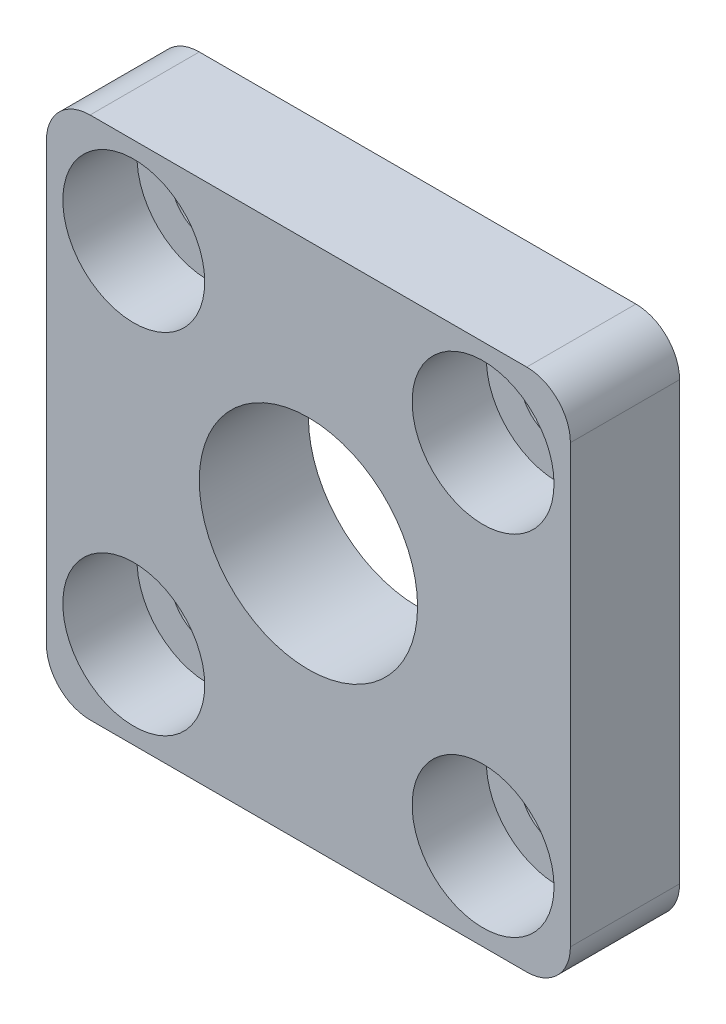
ISO-10303-21;
HEADER;
FILE_DESCRIPTION(('STEP AP214'),'2;1');
FILE_NAME('part.step','',(''),(''),'','','');
FILE_SCHEMA(('AUTOMOTIVE_DESIGN { 1 0 10303 214 1 1 1 1 }'));
ENDSEC;
DATA;
#1=APPLICATION_CONTEXT('core data for automotive mechanical design processes');
#2=APPLICATION_PROTOCOL_DEFINITION('international standard','automotive_design',2000,#1);
#3=PRODUCT_CONTEXT('',#1,'mechanical');
#4=PRODUCT('Part','Part','',(#3));
#5=PRODUCT_RELATED_PRODUCT_CATEGORY('part','',(#4));
#6=PRODUCT_DEFINITION_FORMATION('','',#4);
#7=PRODUCT_DEFINITION_CONTEXT('part definition',#1,'design');
#8=PRODUCT_DEFINITION('design','',#6,#7);
#9=PRODUCT_DEFINITION_SHAPE('','',#8);
#10=(LENGTH_UNIT() NAMED_UNIT(*) SI_UNIT(.MILLI.,.METRE.));
#11=(NAMED_UNIT(*) PLANE_ANGLE_UNIT() SI_UNIT($,.RADIAN.));
#12=(NAMED_UNIT(*) SI_UNIT($,.STERADIAN.) SOLID_ANGLE_UNIT());
#13=UNCERTAINTY_MEASURE_WITH_UNIT(LENGTH_MEASURE(1.E-05),#10,'distance_accuracy_value','');
#14=(GEOMETRIC_REPRESENTATION_CONTEXT(3) GLOBAL_UNCERTAINTY_ASSIGNED_CONTEXT((#13)) GLOBAL_UNIT_ASSIGNED_CONTEXT((#10,
#11,#12)) REPRESENTATION_CONTEXT('',''));
#15=CARTESIAN_POINT('',(0.,0.,0.));
#16=DIRECTION('',(0.,0.,1.));
#17=DIRECTION('',(1.,0.,0.));
#18=AXIS2_PLACEMENT_3D('',#15,#16,#17);
#19=CARTESIAN_POINT('',(0.,0.,5.));
#20=DIRECTION('',(0.,0.,-1.));
#21=DIRECTION('',(-1.,0.,0.));
#22=AXIS2_PLACEMENT_3D('',#19,#20,#21);
#23=PLANE('',#22);
#24=CARTESIAN_POINT('',(-8.,8.,5.));
#25=DIRECTION('',(0.,0.,1.));
#26=DIRECTION('',(1.,0.,0.));
#27=AXIS2_PLACEMENT_3D('',#24,#25,#26);
#28=CIRCLE('',#27,3.25);
#29=CARTESIAN_POINT('',(-4.75,8.,5.));
#30=VERTEX_POINT('',#29);
#31=EDGE_CURVE('E267',#30,#30,#28,.T.);
#32=ORIENTED_EDGE('',*,*,#31,.F.);
#33=EDGE_LOOP('',(#32));
#34=FACE_BOUND('',#33,.T.);
#35=CARTESIAN_POINT('',(8.,8.,5.));
#36=DIRECTION('',(0.,0.,1.));
#37=DIRECTION('',(1.,0.,0.));
#38=AXIS2_PLACEMENT_3D('',#35,#36,#37);
#39=CIRCLE('',#38,3.25);
#40=CARTESIAN_POINT('',(11.25,8.,5.));
#41=VERTEX_POINT('',#40);
#42=EDGE_CURVE('E251',#41,#41,#39,.T.);
#43=ORIENTED_EDGE('',*,*,#42,.F.);
#44=EDGE_LOOP('',(#43));
#45=FACE_BOUND('',#44,.T.);
#46=CARTESIAN_POINT('',(8.,-8.,5.));
#47=DIRECTION('',(0.,0.,1.));
#48=DIRECTION('',(1.,0.,0.));
#49=AXIS2_PLACEMENT_3D('',#46,#47,#48);
#50=CIRCLE('',#49,3.25);
#51=CARTESIAN_POINT('',(11.25,-8.,5.));
#52=VERTEX_POINT('',#51);
#53=EDGE_CURVE('E235',#52,#52,#50,.T.);
#54=ORIENTED_EDGE('',*,*,#53,.F.);
#55=EDGE_LOOP('',(#54));
#56=FACE_BOUND('',#55,.T.);
#57=CARTESIAN_POINT('',(-8.,-8.,5.));
#58=DIRECTION('',(0.,0.,1.));
#59=DIRECTION('',(1.,0.,0.));
#60=AXIS2_PLACEMENT_3D('',#57,#58,#59);
#61=CIRCLE('',#60,3.25);
#62=CARTESIAN_POINT('',(-4.75,-8.,5.));
#63=VERTEX_POINT('',#62);
#64=EDGE_CURVE('E219',#63,#63,#61,.T.);
#65=ORIENTED_EDGE('',*,*,#64,.F.);
#66=EDGE_LOOP('',(#65));
#67=FACE_BOUND('',#66,.T.);
#68=DIRECTION('',(0.,-1.,0.));
#69=VECTOR('',#68,1.);
#70=CARTESIAN_POINT('',(-12.,-12.,5.));
#71=LINE('',#70,#69);
#72=CARTESIAN_POINT('',(-12.,10.,5.));
#73=VERTEX_POINT('',#72);
#74=CARTESIAN_POINT('',(-12.,-10.,5.));
#75=VERTEX_POINT('',#74);
#76=EDGE_CURVE('E194',#73,#75,#71,.T.);
#77=ORIENTED_EDGE('',*,*,#76,.T.);
#78=CARTESIAN_POINT('',(-10.,-10.,5.));
#79=DIRECTION('',(0.,0.,-1.));
#80=DIRECTION('',(-1.,0.,0.));
#81=AXIS2_PLACEMENT_3D('',#78,#79,#80);
#82=CIRCLE('',#81,2.);
#83=CARTESIAN_POINT('',(-10.,-12.,5.));
#84=VERTEX_POINT('',#83);
#85=EDGE_CURVE('E168',#75,#84,#82,.F.);
#86=ORIENTED_EDGE('',*,*,#85,.T.);
#87=DIRECTION('',(1.,0.,0.));
#88=VECTOR('',#87,1.);
#89=CARTESIAN_POINT('',(-12.,-12.,5.));
#90=LINE('',#89,#88);
#91=CARTESIAN_POINT('',(10.,-12.,5.));
#92=VERTEX_POINT('',#91);
#93=EDGE_CURVE('E125',#84,#92,#90,.T.);
#94=ORIENTED_EDGE('',*,*,#93,.T.);
#95=CARTESIAN_POINT('',(10.,-10.,5.));
#96=DIRECTION('',(0.,0.,-1.));
#97=DIRECTION('',(-1.,0.,0.));
#98=AXIS2_PLACEMENT_3D('',#95,#96,#97);
#99=CIRCLE('',#98,2.);
#100=CARTESIAN_POINT('',(12.,-10.,5.));
#101=VERTEX_POINT('',#100);
#102=EDGE_CURVE('E165',#92,#101,#99,.F.);
#103=ORIENTED_EDGE('',*,*,#102,.T.);
#104=DIRECTION('',(0.,1.,0.));
#105=VECTOR('',#104,1.);
#106=CARTESIAN_POINT('',(12.,-12.,5.));
#107=LINE('',#106,#105);
#108=CARTESIAN_POINT('',(12.,10.,5.));
#109=VERTEX_POINT('',#108);
#110=EDGE_CURVE('E134',#101,#109,#107,.T.);
#111=ORIENTED_EDGE('',*,*,#110,.T.);
#112=CARTESIAN_POINT('',(10.,10.,5.));
#113=DIRECTION('',(0.,0.,-1.));
#114=DIRECTION('',(-1.,0.,0.));
#115=AXIS2_PLACEMENT_3D('',#112,#113,#114);
#116=CIRCLE('',#115,2.);
#117=CARTESIAN_POINT('',(10.,12.,5.));
#118=VERTEX_POINT('',#117);
#119=EDGE_CURVE('E59',#109,#118,#116,.F.);
#120=ORIENTED_EDGE('',*,*,#119,.T.);
#121=DIRECTION('',(-1.,0.,0.));
#122=VECTOR('',#121,1.);
#123=CARTESIAN_POINT('',(-12.,12.,5.));
#124=LINE('',#123,#122);
#125=CARTESIAN_POINT('',(-10.,12.,5.));
#126=VERTEX_POINT('',#125);
#127=EDGE_CURVE('E140',#118,#126,#124,.T.);
#128=ORIENTED_EDGE('',*,*,#127,.T.);
#129=CARTESIAN_POINT('',(-10.,10.,5.));
#130=DIRECTION('',(0.,0.,-1.));
#131=DIRECTION('',(-1.,0.,0.));
#132=AXIS2_PLACEMENT_3D('',#129,#130,#131);
#133=CIRCLE('',#132,2.);
#134=EDGE_CURVE('E162',#126,#73,#133,.F.);
#135=ORIENTED_EDGE('',*,*,#134,.T.);
#136=EDGE_LOOP('',(#77,#86,#94,#103,#111,#120,#128,#135));
#137=FACE_BOUND('',#136,.T.);
#138=CARTESIAN_POINT('',(0.,0.,5.));
#139=DIRECTION('',(0.,0.,1.));
#140=DIRECTION('',(1.,0.,0.));
#141=AXIS2_PLACEMENT_3D('',#138,#139,#140);
#142=CIRCLE('',#141,5.);
#143=CARTESIAN_POINT('',(5.,0.,5.));
#144=VERTEX_POINT('',#143);
#145=EDGE_CURVE('E189',#144,#144,#142,.T.);
#146=ORIENTED_EDGE('',*,*,#145,.F.);
#147=EDGE_LOOP('',(#146));
#148=FACE_BOUND('',#147,.T.);
#149=ADVANCED_FACE('F38',(#34,#45,#56,#67,#137,#148),#23,.F.);
#150=CARTESIAN_POINT('',(0.,0.,0.));
#151=DIRECTION('',(0.,0.,-1.));
#152=DIRECTION('',(-1.,0.,0.));
#153=AXIS2_PLACEMENT_3D('',#150,#151,#152);
#154=PLANE('',#153);
#155=CARTESIAN_POINT('',(-8.,8.,0.));
#156=DIRECTION('',(0.,0.,1.));
#157=DIRECTION('',(1.,0.,0.));
#158=AXIS2_PLACEMENT_3D('',#155,#156,#157);
#159=CIRCLE('',#158,1.7);
#160=CARTESIAN_POINT('',(-6.3,8.,0.));
#161=VERTEX_POINT('',#160);
#162=EDGE_CURVE('E255',#161,#161,#159,.T.);
#163=ORIENTED_EDGE('',*,*,#162,.T.);
#164=EDGE_LOOP('',(#163));
#165=FACE_BOUND('',#164,.T.);
#166=CARTESIAN_POINT('',(8.,8.,0.));
#167=DIRECTION('',(0.,0.,1.));
#168=DIRECTION('',(1.,0.,0.));
#169=AXIS2_PLACEMENT_3D('',#166,#167,#168);
#170=CIRCLE('',#169,1.7);
#171=CARTESIAN_POINT('',(9.7,8.,0.));
#172=VERTEX_POINT('',#171);
#173=EDGE_CURVE('E239',#172,#172,#170,.T.);
#174=ORIENTED_EDGE('',*,*,#173,.T.);
#175=EDGE_LOOP('',(#174));
#176=FACE_BOUND('',#175,.T.);
#177=CARTESIAN_POINT('',(8.,-8.,0.));
#178=DIRECTION('',(0.,0.,1.));
#179=DIRECTION('',(1.,0.,0.));
#180=AXIS2_PLACEMENT_3D('',#177,#178,#179);
#181=CIRCLE('',#180,1.7);
#182=CARTESIAN_POINT('',(9.7,-8.,0.));
#183=VERTEX_POINT('',#182);
#184=EDGE_CURVE('E223',#183,#183,#181,.T.);
#185=ORIENTED_EDGE('',*,*,#184,.T.);
#186=EDGE_LOOP('',(#185));
#187=FACE_BOUND('',#186,.T.);
#188=CARTESIAN_POINT('',(-8.,-8.,0.));
#189=DIRECTION('',(0.,0.,1.));
#190=DIRECTION('',(1.,0.,0.));
#191=AXIS2_PLACEMENT_3D('',#188,#189,#190);
#192=CIRCLE('',#191,1.7);
#193=CARTESIAN_POINT('',(-6.3,-8.,0.));
#194=VERTEX_POINT('',#193);
#195=EDGE_CURVE('E204',#194,#194,#192,.T.);
#196=ORIENTED_EDGE('',*,*,#195,.T.);
#197=EDGE_LOOP('',(#196));
#198=FACE_BOUND('',#197,.T.);
#199=DIRECTION('',(1.,0.,0.));
#200=VECTOR('',#199,1.);
#201=CARTESIAN_POINT('',(-12.,-12.,0.));
#202=LINE('',#201,#200);
#203=CARTESIAN_POINT('',(-10.,-12.,0.));
#204=VERTEX_POINT('',#203);
#205=CARTESIAN_POINT('',(10.,-12.,0.));
#206=VERTEX_POINT('',#205);
#207=EDGE_CURVE('E122',#204,#206,#202,.T.);
#208=ORIENTED_EDGE('',*,*,#207,.F.);
#209=CARTESIAN_POINT('',(-10.,-10.,0.));
#210=DIRECTION('',(0.,0.,-1.));
#211=DIRECTION('',(-1.,0.,0.));
#212=AXIS2_PLACEMENT_3D('',#209,#210,#211);
#213=CIRCLE('',#212,2.);
#214=CARTESIAN_POINT('',(-12.,-10.,0.));
#215=VERTEX_POINT('',#214);
#216=EDGE_CURVE('E104',#204,#215,#213,.T.);
#217=ORIENTED_EDGE('',*,*,#216,.T.);
#218=DIRECTION('',(0.,-1.,0.));
#219=VECTOR('',#218,1.);
#220=CARTESIAN_POINT('',(-12.,-12.,0.));
#221=LINE('',#220,#219);
#222=CARTESIAN_POINT('',(-12.,10.,0.));
#223=VERTEX_POINT('',#222);
#224=EDGE_CURVE('E135',#223,#215,#221,.T.);
#225=ORIENTED_EDGE('',*,*,#224,.F.);
#226=CARTESIAN_POINT('',(-10.,10.,0.));
#227=DIRECTION('',(0.,0.,-1.));
#228=DIRECTION('',(-1.,0.,0.));
#229=AXIS2_PLACEMENT_3D('',#226,#227,#228);
#230=CIRCLE('',#229,2.);
#231=CARTESIAN_POINT('',(-10.,12.,0.));
#232=VERTEX_POINT('',#231);
#233=EDGE_CURVE('E150',#223,#232,#230,.T.);
#234=ORIENTED_EDGE('',*,*,#233,.T.);
#235=DIRECTION('',(-1.,0.,0.));
#236=VECTOR('',#235,1.);
#237=CARTESIAN_POINT('',(-12.,12.,0.));
#238=LINE('',#237,#236);
#239=CARTESIAN_POINT('',(10.,12.,0.));
#240=VERTEX_POINT('',#239);
#241=EDGE_CURVE('E142',#240,#232,#238,.T.);
#242=ORIENTED_EDGE('',*,*,#241,.F.);
#243=CARTESIAN_POINT('',(10.,10.,0.));
#244=DIRECTION('',(0.,0.,-1.));
#245=DIRECTION('',(-1.,0.,0.));
#246=AXIS2_PLACEMENT_3D('',#243,#244,#245);
#247=CIRCLE('',#246,2.);
#248=CARTESIAN_POINT('',(12.,10.,0.));
#249=VERTEX_POINT('',#248);
#250=EDGE_CURVE('E127',#240,#249,#247,.T.);
#251=ORIENTED_EDGE('',*,*,#250,.T.);
#252=DIRECTION('',(0.,1.,0.));
#253=VECTOR('',#252,1.);
#254=CARTESIAN_POINT('',(12.,-12.,0.));
#255=LINE('',#254,#253);
#256=CARTESIAN_POINT('',(12.,-10.,0.));
#257=VERTEX_POINT('',#256);
#258=EDGE_CURVE('E186',#257,#249,#255,.T.);
#259=ORIENTED_EDGE('',*,*,#258,.F.);
#260=CARTESIAN_POINT('',(10.,-10.,0.));
#261=DIRECTION('',(0.,0.,-1.));
#262=DIRECTION('',(-1.,0.,0.));
#263=AXIS2_PLACEMENT_3D('',#260,#261,#262);
#264=CIRCLE('',#263,2.);
#265=EDGE_CURVE('E116',#257,#206,#264,.T.);
#266=ORIENTED_EDGE('',*,*,#265,.T.);
#267=EDGE_LOOP('',(#208,#217,#225,#234,#242,#251,#259,#266));
#268=FACE_BOUND('',#267,.T.);
#269=CARTESIAN_POINT('',(0.,0.,0.));
#270=DIRECTION('',(0.,0.,1.));
#271=DIRECTION('',(1.,0.,0.));
#272=AXIS2_PLACEMENT_3D('',#269,#270,#271);
#273=CIRCLE('',#272,5.);
#274=CARTESIAN_POINT('',(5.,0.,0.));
#275=VERTEX_POINT('',#274);
#276=EDGE_CURVE('E200',#275,#275,#273,.T.);
#277=ORIENTED_EDGE('',*,*,#276,.T.);
#278=EDGE_LOOP('',(#277));
#279=FACE_BOUND('',#278,.T.);
#280=ADVANCED_FACE('F130',(#165,#176,#187,#198,#268,#279),#154,.T.);
#281=CARTESIAN_POINT('',(12.,-12.,5.));
#282=DIRECTION('',(-1.,0.,0.));
#283=DIRECTION('',(0.,0.,1.));
#284=AXIS2_PLACEMENT_3D('',#281,#282,#283);
#285=PLANE('',#284);
#286=ORIENTED_EDGE('',*,*,#110,.F.);
#287=DIRECTION('',(0.,0.,-1.));
#288=VECTOR('',#287,1.);
#289=CARTESIAN_POINT('',(12.,-10.,5.));
#290=LINE('',#289,#288);
#291=EDGE_CURVE('E174',#101,#257,#290,.T.);
#292=ORIENTED_EDGE('',*,*,#291,.T.);
#293=ORIENTED_EDGE('',*,*,#258,.T.);
#294=DIRECTION('',(0.,0.,-1.));
#295=VECTOR('',#294,1.);
#296=CARTESIAN_POINT('',(12.,10.,5.));
#297=LINE('',#296,#295);
#298=EDGE_CURVE('E171',#249,#109,#297,.F.);
#299=ORIENTED_EDGE('',*,*,#298,.T.);
#300=EDGE_LOOP('',(#286,#292,#293,#299));
#301=FACE_BOUND('',#300,.T.);
#302=ADVANCED_FACE('F294',(#301),#285,.F.);
#303=CARTESIAN_POINT('',(-12.,12.,5.));
#304=DIRECTION('',(0.,-1.,0.));
#305=DIRECTION('',(0.,0.,-1.));
#306=AXIS2_PLACEMENT_3D('',#303,#304,#305);
#307=PLANE('',#306);
#308=ORIENTED_EDGE('',*,*,#241,.T.);
#309=DIRECTION('',(0.,0.,-1.));
#310=VECTOR('',#309,1.);
#311=CARTESIAN_POINT('',(-10.,12.,5.));
#312=LINE('',#311,#310);
#313=EDGE_CURVE('E11',#232,#126,#312,.F.);
#314=ORIENTED_EDGE('',*,*,#313,.T.);
#315=ORIENTED_EDGE('',*,*,#127,.F.);
#316=DIRECTION('',(0.,0.,-1.));
#317=VECTOR('',#316,1.);
#318=CARTESIAN_POINT('',(10.,12.,5.));
#319=LINE('',#318,#317);
#320=EDGE_CURVE('E47',#118,#240,#319,.T.);
#321=ORIENTED_EDGE('',*,*,#320,.T.);
#322=EDGE_LOOP('',(#308,#314,#315,#321));
#323=FACE_BOUND('',#322,.T.);
#324=ADVANCED_FACE('F182',(#323),#307,.F.);
#325=CARTESIAN_POINT('',(-12.,-12.,5.));
#326=DIRECTION('',(1.,0.,0.));
#327=DIRECTION('',(0.,0.,-1.));
#328=AXIS2_PLACEMENT_3D('',#325,#326,#327);
#329=PLANE('',#328);
#330=ORIENTED_EDGE('',*,*,#224,.T.);
#331=DIRECTION('',(0.,0.,-1.));
#332=VECTOR('',#331,1.);
#333=CARTESIAN_POINT('',(-12.,-10.,5.));
#334=LINE('',#333,#332);
#335=EDGE_CURVE('E109',#215,#75,#334,.F.);
#336=ORIENTED_EDGE('',*,*,#335,.T.);
#337=ORIENTED_EDGE('',*,*,#76,.F.);
#338=DIRECTION('',(0.,0.,-1.));
#339=VECTOR('',#338,1.);
#340=CARTESIAN_POINT('',(-12.,10.,5.));
#341=LINE('',#340,#339);
#342=EDGE_CURVE('E115',#73,#223,#341,.T.);
#343=ORIENTED_EDGE('',*,*,#342,.T.);
#344=EDGE_LOOP('',(#330,#336,#337,#343));
#345=FACE_BOUND('',#344,.T.);
#346=ADVANCED_FACE('F306',(#345),#329,.F.);
#347=CARTESIAN_POINT('',(-12.,-12.,5.));
#348=DIRECTION('',(0.,1.,0.));
#349=DIRECTION('',(0.,0.,1.));
#350=AXIS2_PLACEMENT_3D('',#347,#348,#349);
#351=PLANE('',#350);
#352=ORIENTED_EDGE('',*,*,#93,.F.);
#353=DIRECTION('',(0.,0.,-1.));
#354=VECTOR('',#353,1.);
#355=CARTESIAN_POINT('',(-10.,-12.,5.));
#356=LINE('',#355,#354);
#357=EDGE_CURVE('E108',#84,#204,#356,.T.);
#358=ORIENTED_EDGE('',*,*,#357,.T.);
#359=ORIENTED_EDGE('',*,*,#207,.T.);
#360=DIRECTION('',(0.,0.,-1.));
#361=VECTOR('',#360,1.);
#362=CARTESIAN_POINT('',(10.,-12.,5.));
#363=LINE('',#362,#361);
#364=EDGE_CURVE('E128',#206,#92,#363,.F.);
#365=ORIENTED_EDGE('',*,*,#364,.T.);
#366=EDGE_LOOP('',(#352,#358,#359,#365));
#367=FACE_BOUND('',#366,.T.);
#368=ADVANCED_FACE('F121',(#367),#351,.F.);
#369=CARTESIAN_POINT('',(0.,0.,5.));
#370=DIRECTION('',(0.,0.,-1.));
#371=DIRECTION('',(-1.,0.,0.));
#372=AXIS2_PLACEMENT_3D('',#369,#370,#371);
#373=CYLINDRICAL_SURFACE('',#372,5.);
#374=ORIENTED_EDGE('',*,*,#145,.T.);
#375=EDGE_LOOP('',(#374));
#376=FACE_BOUND('',#375,.T.);
#377=ORIENTED_EDGE('',*,*,#276,.F.);
#378=EDGE_LOOP('',(#377));
#379=FACE_BOUND('',#378,.T.);
#380=ADVANCED_FACE('F287',(#376,#379),#373,.F.);
#381=CARTESIAN_POINT('',(-8.,-8.,5.));
#382=DIRECTION('',(0.,0.,1.));
#383=DIRECTION('',(1.,0.,0.));
#384=AXIS2_PLACEMENT_3D('',#381,#382,#383);
#385=CYLINDRICAL_SURFACE('',#384,1.70000000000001);
#386=ORIENTED_EDGE('',*,*,#195,.F.);
#387=EDGE_LOOP('',(#386));
#388=FACE_BOUND('',#387,.T.);
#389=CARTESIAN_POINT('',(-8.,-8.,1.6));
#390=DIRECTION('',(0.,0.,1.));
#391=DIRECTION('',(1.,0.,0.));
#392=AXIS2_PLACEMENT_3D('',#389,#390,#391);
#393=CIRCLE('',#392,1.70000000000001);
#394=CARTESIAN_POINT('',(-6.29999999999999,-8.,1.6));
#395=VERTEX_POINT('',#394);
#396=EDGE_CURVE('E211',#395,#395,#393,.T.);
#397=ORIENTED_EDGE('',*,*,#396,.T.);
#398=EDGE_LOOP('',(#397));
#399=FACE_BOUND('',#398,.T.);
#400=ADVANCED_FACE('F290',(#388,#399),#385,.F.);
#401=CARTESIAN_POINT('',(-6.29999999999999,-8.,1.6));
#402=DIRECTION('',(0.,0.,-1.));
#403=DIRECTION('',(-1.,0.,0.));
#404=AXIS2_PLACEMENT_3D('',#401,#402,#403);
#405=PLANE('',#404);
#406=ORIENTED_EDGE('',*,*,#396,.F.);
#407=EDGE_LOOP('',(#406));
#408=FACE_BOUND('',#407,.T.);
#409=CARTESIAN_POINT('',(-8.,-8.,1.6));
#410=DIRECTION('',(0.,0.,1.));
#411=DIRECTION('',(1.,0.,0.));
#412=AXIS2_PLACEMENT_3D('',#409,#410,#411);
#413=CIRCLE('',#412,3.25);
#414=CARTESIAN_POINT('',(-4.75,-8.,1.6));
#415=VERTEX_POINT('',#414);
#416=EDGE_CURVE('E215',#415,#415,#413,.T.);
#417=ORIENTED_EDGE('',*,*,#416,.T.);
#418=EDGE_LOOP('',(#417));
#419=FACE_BOUND('',#418,.T.);
#420=ADVANCED_FACE('F448',(#408,#419),#405,.F.);
#421=CARTESIAN_POINT('',(-8.,-8.,5.));
#422=DIRECTION('',(0.,0.,1.));
#423=DIRECTION('',(1.,0.,0.));
#424=AXIS2_PLACEMENT_3D('',#421,#422,#423);
#425=CYLINDRICAL_SURFACE('',#424,3.25);
#426=ORIENTED_EDGE('',*,*,#416,.F.);
#427=EDGE_LOOP('',(#426));
#428=FACE_BOUND('',#427,.T.);
#429=ORIENTED_EDGE('',*,*,#64,.T.);
#430=EDGE_LOOP('',(#429));
#431=FACE_BOUND('',#430,.T.);
#432=ADVANCED_FACE('F438',(#428,#431),#425,.F.);
#433=CARTESIAN_POINT('',(8.,-8.,5.));
#434=DIRECTION('',(0.,0.,1.));
#435=DIRECTION('',(1.,0.,0.));
#436=AXIS2_PLACEMENT_3D('',#433,#434,#435);
#437=CYLINDRICAL_SURFACE('',#436,1.70000000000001);
#438=ORIENTED_EDGE('',*,*,#184,.F.);
#439=EDGE_LOOP('',(#438));
#440=FACE_BOUND('',#439,.T.);
#441=CARTESIAN_POINT('',(8.,-8.,1.6));
#442=DIRECTION('',(0.,0.,1.));
#443=DIRECTION('',(1.,0.,0.));
#444=AXIS2_PLACEMENT_3D('',#441,#442,#443);
#445=CIRCLE('',#444,1.70000000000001);
#446=CARTESIAN_POINT('',(9.70000000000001,-8.,1.6));
#447=VERTEX_POINT('',#446);
#448=EDGE_CURVE('E227',#447,#447,#445,.T.);
#449=ORIENTED_EDGE('',*,*,#448,.T.);
#450=EDGE_LOOP('',(#449));
#451=FACE_BOUND('',#450,.T.);
#452=ADVANCED_FACE('F428',(#440,#451),#437,.F.);
#453=CARTESIAN_POINT('',(9.70000000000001,-8.,1.6));
#454=DIRECTION('',(0.,0.,-1.));
#455=DIRECTION('',(-1.,0.,0.));
#456=AXIS2_PLACEMENT_3D('',#453,#454,#455);
#457=PLANE('',#456);
#458=ORIENTED_EDGE('',*,*,#448,.F.);
#459=EDGE_LOOP('',(#458));
#460=FACE_BOUND('',#459,.T.);
#461=CARTESIAN_POINT('',(8.,-8.,1.6));
#462=DIRECTION('',(0.,0.,1.));
#463=DIRECTION('',(1.,0.,0.));
#464=AXIS2_PLACEMENT_3D('',#461,#462,#463);
#465=CIRCLE('',#464,3.25);
#466=CARTESIAN_POINT('',(11.25,-8.,1.6));
#467=VERTEX_POINT('',#466);
#468=EDGE_CURVE('E231',#467,#467,#465,.T.);
#469=ORIENTED_EDGE('',*,*,#468,.T.);
#470=EDGE_LOOP('',(#469));
#471=FACE_BOUND('',#470,.T.);
#472=ADVANCED_FACE('F418',(#460,#471),#457,.F.);
#473=CARTESIAN_POINT('',(8.,-8.,5.));
#474=DIRECTION('',(0.,0.,1.));
#475=DIRECTION('',(1.,0.,0.));
#476=AXIS2_PLACEMENT_3D('',#473,#474,#475);
#477=CYLINDRICAL_SURFACE('',#476,3.25);
#478=ORIENTED_EDGE('',*,*,#468,.F.);
#479=EDGE_LOOP('',(#478));
#480=FACE_BOUND('',#479,.T.);
#481=ORIENTED_EDGE('',*,*,#53,.T.);
#482=EDGE_LOOP('',(#481));
#483=FACE_BOUND('',#482,.T.);
#484=ADVANCED_FACE('F408',(#480,#483),#477,.F.);
#485=CARTESIAN_POINT('',(8.,8.,5.));
#486=DIRECTION('',(0.,0.,1.));
#487=DIRECTION('',(1.,0.,0.));
#488=AXIS2_PLACEMENT_3D('',#485,#486,#487);
#489=CYLINDRICAL_SURFACE('',#488,1.70000000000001);
#490=ORIENTED_EDGE('',*,*,#173,.F.);
#491=EDGE_LOOP('',(#490));
#492=FACE_BOUND('',#491,.T.);
#493=CARTESIAN_POINT('',(8.,8.,1.6));
#494=DIRECTION('',(0.,0.,1.));
#495=DIRECTION('',(1.,0.,0.));
#496=AXIS2_PLACEMENT_3D('',#493,#494,#495);
#497=CIRCLE('',#496,1.70000000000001);
#498=CARTESIAN_POINT('',(9.70000000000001,8.,1.6));
#499=VERTEX_POINT('',#498);
#500=EDGE_CURVE('E243',#499,#499,#497,.T.);
#501=ORIENTED_EDGE('',*,*,#500,.T.);
#502=EDGE_LOOP('',(#501));
#503=FACE_BOUND('',#502,.T.);
#504=ADVANCED_FACE('F398',(#492,#503),#489,.F.);
#505=CARTESIAN_POINT('',(9.70000000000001,8.,1.6));
#506=DIRECTION('',(0.,0.,-1.));
#507=DIRECTION('',(-1.,0.,0.));
#508=AXIS2_PLACEMENT_3D('',#505,#506,#507);
#509=PLANE('',#508);
#510=ORIENTED_EDGE('',*,*,#500,.F.);
#511=EDGE_LOOP('',(#510));
#512=FACE_BOUND('',#511,.T.);
#513=CARTESIAN_POINT('',(8.,8.,1.6));
#514=DIRECTION('',(0.,0.,1.));
#515=DIRECTION('',(1.,0.,0.));
#516=AXIS2_PLACEMENT_3D('',#513,#514,#515);
#517=CIRCLE('',#516,3.25);
#518=CARTESIAN_POINT('',(11.25,8.,1.6));
#519=VERTEX_POINT('',#518);
#520=EDGE_CURVE('E247',#519,#519,#517,.T.);
#521=ORIENTED_EDGE('',*,*,#520,.T.);
#522=EDGE_LOOP('',(#521));
#523=FACE_BOUND('',#522,.T.);
#524=ADVANCED_FACE('F388',(#512,#523),#509,.F.);
#525=CARTESIAN_POINT('',(8.,8.,5.));
#526=DIRECTION('',(0.,0.,1.));
#527=DIRECTION('',(1.,0.,0.));
#528=AXIS2_PLACEMENT_3D('',#525,#526,#527);
#529=CYLINDRICAL_SURFACE('',#528,3.25);
#530=ORIENTED_EDGE('',*,*,#520,.F.);
#531=EDGE_LOOP('',(#530));
#532=FACE_BOUND('',#531,.T.);
#533=ORIENTED_EDGE('',*,*,#42,.T.);
#534=EDGE_LOOP('',(#533));
#535=FACE_BOUND('',#534,.T.);
#536=ADVANCED_FACE('F378',(#532,#535),#529,.F.);
#537=CARTESIAN_POINT('',(-8.,8.,5.));
#538=DIRECTION('',(0.,0.,1.));
#539=DIRECTION('',(1.,0.,0.));
#540=AXIS2_PLACEMENT_3D('',#537,#538,#539);
#541=CYLINDRICAL_SURFACE('',#540,1.70000000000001);
#542=ORIENTED_EDGE('',*,*,#162,.F.);
#543=EDGE_LOOP('',(#542));
#544=FACE_BOUND('',#543,.T.);
#545=CARTESIAN_POINT('',(-8.,8.,1.6));
#546=DIRECTION('',(0.,0.,1.));
#547=DIRECTION('',(1.,0.,0.));
#548=AXIS2_PLACEMENT_3D('',#545,#546,#547);
#549=CIRCLE('',#548,1.70000000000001);
#550=CARTESIAN_POINT('',(-6.29999999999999,8.,1.6));
#551=VERTEX_POINT('',#550);
#552=EDGE_CURVE('E259',#551,#551,#549,.T.);
#553=ORIENTED_EDGE('',*,*,#552,.T.);
#554=EDGE_LOOP('',(#553));
#555=FACE_BOUND('',#554,.T.);
#556=ADVANCED_FACE('F368',(#544,#555),#541,.F.);
#557=CARTESIAN_POINT('',(-6.29999999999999,8.,1.6));
#558=DIRECTION('',(0.,0.,-1.));
#559=DIRECTION('',(-1.,0.,0.));
#560=AXIS2_PLACEMENT_3D('',#557,#558,#559);
#561=PLANE('',#560);
#562=ORIENTED_EDGE('',*,*,#552,.F.);
#563=EDGE_LOOP('',(#562));
#564=FACE_BOUND('',#563,.T.);
#565=CARTESIAN_POINT('',(-8.,8.,1.6));
#566=DIRECTION('',(0.,0.,1.));
#567=DIRECTION('',(1.,0.,0.));
#568=AXIS2_PLACEMENT_3D('',#565,#566,#567);
#569=CIRCLE('',#568,3.25);
#570=CARTESIAN_POINT('',(-4.75,8.,1.6));
#571=VERTEX_POINT('',#570);
#572=EDGE_CURVE('E263',#571,#571,#569,.T.);
#573=ORIENTED_EDGE('',*,*,#572,.T.);
#574=EDGE_LOOP('',(#573));
#575=FACE_BOUND('',#574,.T.);
#576=ADVANCED_FACE('F357',(#564,#575),#561,.F.);
#577=CARTESIAN_POINT('',(-8.,8.,5.));
#578=DIRECTION('',(0.,0.,1.));
#579=DIRECTION('',(1.,0.,0.));
#580=AXIS2_PLACEMENT_3D('',#577,#578,#579);
#581=CYLINDRICAL_SURFACE('',#580,3.25);
#582=ORIENTED_EDGE('',*,*,#572,.F.);
#583=EDGE_LOOP('',(#582));
#584=FACE_BOUND('',#583,.T.);
#585=ORIENTED_EDGE('',*,*,#31,.T.);
#586=EDGE_LOOP('',(#585));
#587=FACE_BOUND('',#586,.T.);
#588=ADVANCED_FACE('F273',(#584,#587),#581,.F.);
#589=CARTESIAN_POINT('',(-10.,-10.,5.));
#590=DIRECTION('',(0.,0.,-1.));
#591=DIRECTION('',(-1.,0.,0.));
#592=AXIS2_PLACEMENT_3D('',#589,#590,#591);
#593=CYLINDRICAL_SURFACE('',#592,2.);
#594=ORIENTED_EDGE('',*,*,#85,.F.);
#595=ORIENTED_EDGE('',*,*,#335,.F.);
#596=ORIENTED_EDGE('',*,*,#216,.F.);
#597=ORIENTED_EDGE('',*,*,#357,.F.);
#598=EDGE_LOOP('',(#594,#595,#596,#597));
#599=FACE_BOUND('',#598,.T.);
#600=ADVANCED_FACE('F107',(#599),#593,.T.);
#601=CARTESIAN_POINT('',(10.,-10.,5.));
#602=DIRECTION('',(0.,0.,-1.));
#603=DIRECTION('',(-1.,0.,0.));
#604=AXIS2_PLACEMENT_3D('',#601,#602,#603);
#605=CYLINDRICAL_SURFACE('',#604,2.);
#606=ORIENTED_EDGE('',*,*,#102,.F.);
#607=ORIENTED_EDGE('',*,*,#364,.F.);
#608=ORIENTED_EDGE('',*,*,#265,.F.);
#609=ORIENTED_EDGE('',*,*,#291,.F.);
#610=EDGE_LOOP('',(#606,#607,#608,#609));
#611=FACE_BOUND('',#610,.T.);
#612=ADVANCED_FACE('F314',(#611),#605,.T.);
#613=CARTESIAN_POINT('',(-10.,10.,5.));
#614=DIRECTION('',(0.,0.,-1.));
#615=DIRECTION('',(-1.,0.,0.));
#616=AXIS2_PLACEMENT_3D('',#613,#614,#615);
#617=CYLINDRICAL_SURFACE('',#616,2.);
#618=ORIENTED_EDGE('',*,*,#134,.F.);
#619=ORIENTED_EDGE('',*,*,#313,.F.);
#620=ORIENTED_EDGE('',*,*,#233,.F.);
#621=ORIENTED_EDGE('',*,*,#342,.F.);
#622=EDGE_LOOP('',(#618,#619,#620,#621));
#623=FACE_BOUND('',#622,.T.);
#624=ADVANCED_FACE('F316',(#623),#617,.T.);
#625=CARTESIAN_POINT('',(10.,10.,5.));
#626=DIRECTION('',(0.,0.,-1.));
#627=DIRECTION('',(-1.,0.,0.));
#628=AXIS2_PLACEMENT_3D('',#625,#626,#627);
#629=CYLINDRICAL_SURFACE('',#628,2.);
#630=ORIENTED_EDGE('',*,*,#119,.F.);
#631=ORIENTED_EDGE('',*,*,#298,.F.);
#632=ORIENTED_EDGE('',*,*,#250,.F.);
#633=ORIENTED_EDGE('',*,*,#320,.F.);
#634=EDGE_LOOP('',(#630,#631,#632,#633));
#635=FACE_BOUND('',#634,.T.);
#636=ADVANCED_FACE('F40',(#635),#629,.T.);
#637=CLOSED_SHELL('',(#149,#280,#302,#324,#346,#368,#380,#400,#420,#432,#452,#472,#484,#504,
#524,#536,#556,#576,#588,#600,#612,#624,#636));
#638=MANIFOLD_SOLID_BREP('B2',#637);
#639=ADVANCED_BREP_SHAPE_REPRESENTATION('',(#18,#638),#14);
#640=SHAPE_DEFINITION_REPRESENTATION(#9,#639);
ENDSEC;
END-ISO-10303-21;
